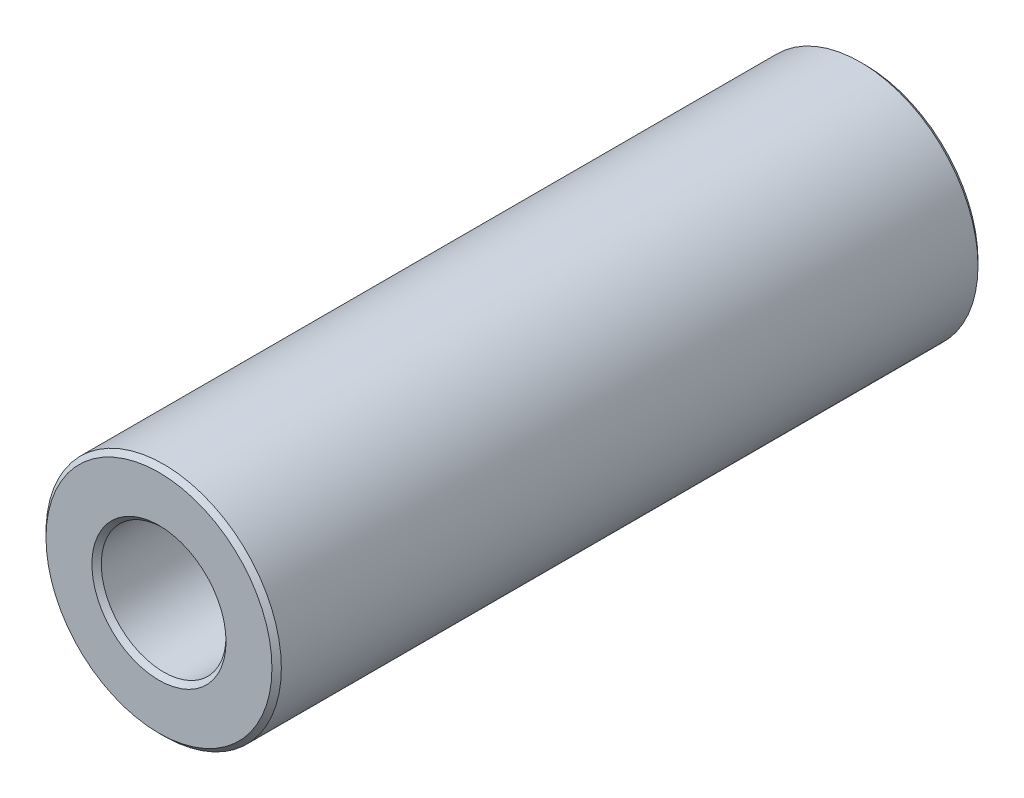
ISO-10303-21;
HEADER;
FILE_DESCRIPTION(('STEP AP214'),'2;1');
FILE_NAME('part.step','',(''),(''),'','','');
FILE_SCHEMA(('AUTOMOTIVE_DESIGN { 1 0 10303 214 1 1 1 1 }'));
ENDSEC;
DATA;
#1=APPLICATION_CONTEXT('core data for automotive mechanical design processes');
#2=APPLICATION_PROTOCOL_DEFINITION('international standard','automotive_design',2000,#1);
#3=PRODUCT_CONTEXT('',#1,'mechanical');
#4=PRODUCT('Part','Part','',(#3));
#5=PRODUCT_RELATED_PRODUCT_CATEGORY('part','',(#4));
#6=PRODUCT_DEFINITION_FORMATION('','',#4);
#7=PRODUCT_DEFINITION_CONTEXT('part definition',#1,'design');
#8=PRODUCT_DEFINITION('design','',#6,#7);
#9=PRODUCT_DEFINITION_SHAPE('','',#8);
#10=(LENGTH_UNIT() NAMED_UNIT(*) SI_UNIT(.MILLI.,.METRE.));
#11=(NAMED_UNIT(*) PLANE_ANGLE_UNIT() SI_UNIT($,.RADIAN.));
#12=(NAMED_UNIT(*) SI_UNIT($,.STERADIAN.) SOLID_ANGLE_UNIT());
#13=UNCERTAINTY_MEASURE_WITH_UNIT(LENGTH_MEASURE(1.E-05),#10,'distance_accuracy_value','');
#14=(GEOMETRIC_REPRESENTATION_CONTEXT(3) GLOBAL_UNCERTAINTY_ASSIGNED_CONTEXT((#13)) GLOBAL_UNIT_ASSIGNED_CONTEXT((#10,
#11,#12)) REPRESENTATION_CONTEXT('',''));
#15=CARTESIAN_POINT('',(0.,0.,0.));
#16=DIRECTION('',(0.,0.,1.));
#17=DIRECTION('',(1.,0.,0.));
#18=AXIS2_PLACEMENT_3D('',#15,#16,#17);
#19=CARTESIAN_POINT('',(0.,0.,15.));
#20=DIRECTION('',(0.,0.,1.));
#21=DIRECTION('',(1.,0.,0.));
#22=AXIS2_PLACEMENT_3D('',#19,#20,#21);
#23=PLANE('',#22);
#24=CARTESIAN_POINT('',(0.,0.,15.));
#25=DIRECTION('',(0.,0.,1.));
#26=DIRECTION('',(1.,0.,0.));
#27=AXIS2_PLACEMENT_3D('',#24,#25,#26);
#28=CIRCLE('',#27,2.84999999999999);
#29=CARTESIAN_POINT('',(2.84999999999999,0.,15.));
#30=VERTEX_POINT('',#29);
#31=EDGE_CURVE('E10',#30,#30,#28,.F.);
#32=ORIENTED_EDGE('',*,*,#31,.T.);
#33=EDGE_LOOP('',(#32));
#34=FACE_BOUND('',#33,.T.);
#35=CARTESIAN_POINT('',(0.,0.,15.));
#36=DIRECTION('',(0.,0.,1.));
#37=DIRECTION('',(1.,0.,0.));
#38=AXIS2_PLACEMENT_3D('',#35,#36,#37);
#39=CIRCLE('',#38,4.8);
#40=CARTESIAN_POINT('',(4.8,0.,15.));
#41=VERTEX_POINT('',#40);
#42=EDGE_CURVE('E45',#41,#41,#39,.T.);
#43=ORIENTED_EDGE('',*,*,#42,.T.);
#44=EDGE_LOOP('',(#43));
#45=FACE_BOUND('',#44,.T.);
#46=ADVANCED_FACE('F37',(#34,#45),#23,.T.);
#47=CARTESIAN_POINT('',(0.,0.,-15.));
#48=DIRECTION('',(0.,0.,1.));
#49=DIRECTION('',(1.,0.,0.));
#50=AXIS2_PLACEMENT_3D('',#47,#48,#49);
#51=PLANE('',#50);
#52=CARTESIAN_POINT('',(0.,0.,-15.));
#53=DIRECTION('',(0.,0.,1.));
#54=DIRECTION('',(1.,0.,0.));
#55=AXIS2_PLACEMENT_3D('',#52,#53,#54);
#56=CIRCLE('',#55,4.8);
#57=CARTESIAN_POINT('',(4.8,0.,-15.));
#58=VERTEX_POINT('',#57);
#59=EDGE_CURVE('E63',#58,#58,#56,.F.);
#60=ORIENTED_EDGE('',*,*,#59,.T.);
#61=EDGE_LOOP('',(#60));
#62=FACE_BOUND('',#61,.T.);
#63=CARTESIAN_POINT('',(0.,0.,-15.));
#64=DIRECTION('',(0.,0.,1.));
#65=DIRECTION('',(1.,0.,0.));
#66=AXIS2_PLACEMENT_3D('',#63,#64,#65);
#67=CIRCLE('',#66,2.84999999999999);
#68=CARTESIAN_POINT('',(2.84999999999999,0.,-15.));
#69=VERTEX_POINT('',#68);
#70=EDGE_CURVE('E66',#69,#69,#67,.T.);
#71=ORIENTED_EDGE('',*,*,#70,.T.);
#72=EDGE_LOOP('',(#71));
#73=FACE_BOUND('',#72,.T.);
#74=ADVANCED_FACE('F89',(#62,#73),#51,.F.);
#75=CARTESIAN_POINT('',(0.,0.,15.));
#76=DIRECTION('',(0.,0.,-1.));
#77=DIRECTION('',(-1.,0.,0.));
#78=AXIS2_PLACEMENT_3D('',#75,#76,#77);
#79=CYLINDRICAL_SURFACE('',#78,5.);
#80=CARTESIAN_POINT('',(0.,0.,-14.8));
#81=DIRECTION('',(0.,0.,1.));
#82=DIRECTION('',(1.,0.,0.));
#83=AXIS2_PLACEMENT_3D('',#80,#81,#82);
#84=CIRCLE('',#83,5.);
#85=CARTESIAN_POINT('',(5.,0.,-14.8));
#86=VERTEX_POINT('',#85);
#87=EDGE_CURVE('E70',#86,#86,#84,.T.);
#88=ORIENTED_EDGE('',*,*,#87,.T.);
#89=EDGE_LOOP('',(#88));
#90=FACE_BOUND('',#89,.T.);
#91=CARTESIAN_POINT('',(0.,0.,14.8));
#92=DIRECTION('',(0.,0.,1.));
#93=DIRECTION('',(1.,0.,0.));
#94=AXIS2_PLACEMENT_3D('',#91,#92,#93);
#95=CIRCLE('',#94,5.);
#96=CARTESIAN_POINT('',(5.,0.,14.8));
#97=VERTEX_POINT('',#96);
#98=EDGE_CURVE('E74',#97,#97,#95,.F.);
#99=ORIENTED_EDGE('',*,*,#98,.T.);
#100=EDGE_LOOP('',(#99));
#101=FACE_BOUND('',#100,.T.);
#102=ADVANCED_FACE('F78',(#90,#101),#79,.T.);
#103=CARTESIAN_POINT('',(0.,0.,15.));
#104=DIRECTION('',(0.,0.,-1.));
#105=DIRECTION('',(-1.,0.,0.));
#106=AXIS2_PLACEMENT_3D('',#103,#104,#105);
#107=CYLINDRICAL_SURFACE('',#106,2.65);
#108=CARTESIAN_POINT('',(0.,0.,-14.8));
#109=DIRECTION('',(0.,0.,1.));
#110=DIRECTION('',(1.,0.,0.));
#111=AXIS2_PLACEMENT_3D('',#108,#109,#110);
#112=CIRCLE('',#111,2.65);
#113=CARTESIAN_POINT('',(2.65,0.,-14.8));
#114=VERTEX_POINT('',#113);
#115=EDGE_CURVE('E51',#114,#114,#112,.F.);
#116=ORIENTED_EDGE('',*,*,#115,.T.);
#117=EDGE_LOOP('',(#116));
#118=FACE_BOUND('',#117,.T.);
#119=CARTESIAN_POINT('',(0.,0.,14.8));
#120=DIRECTION('',(0.,0.,1.));
#121=DIRECTION('',(1.,0.,0.));
#122=AXIS2_PLACEMENT_3D('',#119,#120,#121);
#123=CIRCLE('',#122,2.65);
#124=CARTESIAN_POINT('',(2.65,0.,14.8));
#125=VERTEX_POINT('',#124);
#126=EDGE_CURVE('E57',#125,#125,#123,.T.);
#127=ORIENTED_EDGE('',*,*,#126,.T.);
#128=EDGE_LOOP('',(#127));
#129=FACE_BOUND('',#128,.T.);
#130=ADVANCED_FACE('F97',(#118,#129),#107,.F.);
#131=CARTESIAN_POINT('',(0.,0.,-14.8));
#132=DIRECTION('',(0.,0.,1.));
#133=DIRECTION('',(1.,0.,0.));
#134=AXIS2_PLACEMENT_3D('',#131,#132,#133);
#135=CONICAL_SURFACE('',#134,5.,0.785398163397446);
#136=ORIENTED_EDGE('',*,*,#59,.F.);
#137=EDGE_LOOP('',(#136));
#138=FACE_BOUND('',#137,.T.);
#139=ORIENTED_EDGE('',*,*,#87,.F.);
#140=EDGE_LOOP('',(#139));
#141=FACE_BOUND('',#140,.T.);
#142=ADVANCED_FACE('F102',(#138,#141),#135,.T.);
#143=CARTESIAN_POINT('',(0.,0.,-15.));
#144=DIRECTION('',(0.,0.,-1.));
#145=DIRECTION('',(-1.,0.,0.));
#146=AXIS2_PLACEMENT_3D('',#143,#144,#145);
#147=CONICAL_SURFACE('',#146,2.84999999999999,0.785398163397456);
#148=ORIENTED_EDGE('',*,*,#115,.F.);
#149=EDGE_LOOP('',(#148));
#150=FACE_BOUND('',#149,.T.);
#151=ORIENTED_EDGE('',*,*,#70,.F.);
#152=EDGE_LOOP('',(#151));
#153=FACE_BOUND('',#152,.T.);
#154=ADVANCED_FACE('F86',(#150,#153),#147,.F.);
#155=CARTESIAN_POINT('',(0.,0.,14.8));
#156=DIRECTION('',(0.,0.,1.));
#157=DIRECTION('',(1.,0.,0.));
#158=AXIS2_PLACEMENT_3D('',#155,#156,#157);
#159=CONICAL_SURFACE('',#158,2.65,0.785398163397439);
#160=ORIENTED_EDGE('',*,*,#31,.F.);
#161=EDGE_LOOP('',(#160));
#162=FACE_BOUND('',#161,.T.);
#163=ORIENTED_EDGE('',*,*,#126,.F.);
#164=EDGE_LOOP('',(#163));
#165=FACE_BOUND('',#164,.T.);
#166=ADVANCED_FACE('F82',(#162,#165),#159,.F.);
#167=CARTESIAN_POINT('',(0.,0.,15.));
#168=DIRECTION('',(0.,0.,-1.));
#169=DIRECTION('',(-1.,0.,0.));
#170=AXIS2_PLACEMENT_3D('',#167,#168,#169);
#171=CONICAL_SURFACE('',#170,4.8,0.785398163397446);
#172=ORIENTED_EDGE('',*,*,#98,.F.);
#173=EDGE_LOOP('',(#172));
#174=FACE_BOUND('',#173,.T.);
#175=ORIENTED_EDGE('',*,*,#42,.F.);
#176=EDGE_LOOP('',(#175));
#177=FACE_BOUND('',#176,.T.);
#178=ADVANCED_FACE('F39',(#174,#177),#171,.T.);
#179=CLOSED_SHELL('',(#46,#74,#102,#130,#142,#154,#166,#178));
#180=MANIFOLD_SOLID_BREP('B2',#179);
#181=ADVANCED_BREP_SHAPE_REPRESENTATION('',(#18,#180),#14);
#182=SHAPE_DEFINITION_REPRESENTATION(#9,#181);
ENDSEC;
END-ISO-10303-21;
